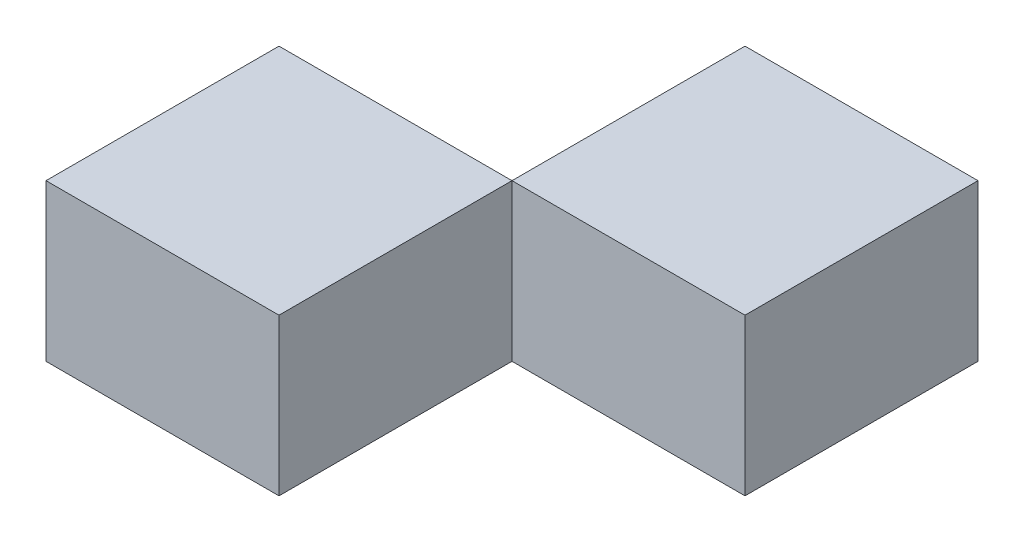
ISO-10303-21;
HEADER;
FILE_DESCRIPTION(('STEP AP214'),'2;1');
FILE_NAME('part.step','',(''),(''),'','','');
FILE_SCHEMA(('AUTOMOTIVE_DESIGN { 1 0 10303 214 1 1 1 1 }'));
ENDSEC;
DATA;
#1=APPLICATION_CONTEXT('core data for automotive mechanical design processes');
#2=APPLICATION_PROTOCOL_DEFINITION('international standard','automotive_design',2000,#1);
#3=PRODUCT_CONTEXT('',#1,'mechanical');
#4=PRODUCT('Part','Part','',(#3));
#5=PRODUCT_RELATED_PRODUCT_CATEGORY('part','',(#4));
#6=PRODUCT_DEFINITION_FORMATION('','',#4);
#7=PRODUCT_DEFINITION_CONTEXT('part definition',#1,'design');
#8=PRODUCT_DEFINITION('design','',#6,#7);
#9=PRODUCT_DEFINITION_SHAPE('','',#8);
#10=(LENGTH_UNIT() NAMED_UNIT(*) SI_UNIT(.MILLI.,.METRE.));
#11=(NAMED_UNIT(*) PLANE_ANGLE_UNIT() SI_UNIT($,.RADIAN.));
#12=(NAMED_UNIT(*) SI_UNIT($,.STERADIAN.) SOLID_ANGLE_UNIT());
#13=UNCERTAINTY_MEASURE_WITH_UNIT(LENGTH_MEASURE(1.E-05),#10,'distance_accuracy_value','');
#14=(GEOMETRIC_REPRESENTATION_CONTEXT(3) GLOBAL_UNCERTAINTY_ASSIGNED_CONTEXT((#13)) GLOBAL_UNIT_ASSIGNED_CONTEXT((#10,
#11,#12)) REPRESENTATION_CONTEXT('',''));
#15=CARTESIAN_POINT('',(0.,0.,0.));
#16=DIRECTION('',(0.,0.,1.));
#17=DIRECTION('',(1.,0.,0.));
#18=AXIS2_PLACEMENT_3D('',#15,#16,#17);
#19=CARTESIAN_POINT('',(0.,13.97,0.));
#20=DIRECTION('',(0.,0.,-1.));
#21=DIRECTION('',(-1.,0.,0.));
#22=AXIS2_PLACEMENT_3D('',#19,#20,#21);
#23=PLANE('',#22);
#24=DIRECTION('',(1.,0.,0.));
#25=VECTOR('',#24,1.);
#26=CARTESIAN_POINT('',(0.,0.,0.));
#27=LINE('',#26,#25);
#28=CARTESIAN_POINT('',(0.,0.,0.));
#29=VERTEX_POINT('',#28);
#30=CARTESIAN_POINT('',(20.8001055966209,0.,0.));
#31=VERTEX_POINT('',#30);
#32=EDGE_CURVE('E107',#29,#31,#27,.T.);
#33=ORIENTED_EDGE('',*,*,#32,.T.);
#34=DIRECTION('',(0.,-1.,0.));
#35=VECTOR('',#34,1.);
#36=CARTESIAN_POINT('',(20.8001055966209,13.97,0.));
#37=LINE('',#36,#35);
#38=CARTESIAN_POINT('',(20.8001055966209,13.97,0.));
#39=VERTEX_POINT('',#38);
#40=EDGE_CURVE('E12',#39,#31,#37,.T.);
#41=ORIENTED_EDGE('',*,*,#40,.F.);
#42=DIRECTION('',(1.,0.,0.));
#43=VECTOR('',#42,1.);
#44=CARTESIAN_POINT('',(0.,13.97,0.));
#45=LINE('',#44,#43);
#46=CARTESIAN_POINT('',(0.,13.97,0.));
#47=VERTEX_POINT('',#46);
#48=EDGE_CURVE('E93',#47,#39,#45,.T.);
#49=ORIENTED_EDGE('',*,*,#48,.F.);
#50=DIRECTION('',(0.,-1.,0.));
#51=VECTOR('',#50,1.);
#52=CARTESIAN_POINT('',(0.,13.97,0.));
#53=LINE('',#52,#51);
#54=EDGE_CURVE('E60',#47,#29,#53,.T.);
#55=ORIENTED_EDGE('',*,*,#54,.T.);
#56=EDGE_LOOP('',(#33,#41,#49,#55));
#57=FACE_BOUND('',#56,.T.);
#58=ADVANCED_FACE('F44',(#57),#23,.F.);
#59=CARTESIAN_POINT('',(20.8001055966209,13.97,0.));
#60=DIRECTION('',(-1.,0.,0.));
#61=DIRECTION('',(0.,0.,1.));
#62=AXIS2_PLACEMENT_3D('',#59,#60,#61);
#63=PLANE('',#62);
#64=DIRECTION('',(0.,0.,-1.));
#65=VECTOR('',#64,1.);
#66=CARTESIAN_POINT('',(20.8001055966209,0.,0.));
#67=LINE('',#66,#65);
#68=CARTESIAN_POINT('',(20.8001055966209,0.,-20.8001055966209));
#69=VERTEX_POINT('',#68);
#70=EDGE_CURVE('E98',#31,#69,#67,.T.);
#71=ORIENTED_EDGE('',*,*,#70,.T.);
#72=DIRECTION('',(0.,-1.,0.));
#73=VECTOR('',#72,1.);
#74=CARTESIAN_POINT('',(20.8001055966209,13.97,-20.8001055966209));
#75=LINE('',#74,#73);
#76=CARTESIAN_POINT('',(20.8001055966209,13.97,-20.8001055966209));
#77=VERTEX_POINT('',#76);
#78=EDGE_CURVE('E52',#77,#69,#75,.T.);
#79=ORIENTED_EDGE('',*,*,#78,.F.);
#80=DIRECTION('',(0.,0.,-1.));
#81=VECTOR('',#80,1.);
#82=CARTESIAN_POINT('',(20.8001055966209,13.97,0.));
#83=LINE('',#82,#81);
#84=EDGE_CURVE('E85',#39,#77,#83,.T.);
#85=ORIENTED_EDGE('',*,*,#84,.F.);
#86=ORIENTED_EDGE('',*,*,#40,.T.);
#87=EDGE_LOOP('',(#71,#79,#85,#86));
#88=FACE_BOUND('',#87,.T.);
#89=ADVANCED_FACE('F97',(#88),#63,.F.);
#90=CARTESIAN_POINT('',(0.,13.97,-20.8001055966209));
#91=DIRECTION('',(0.,0.,-1.));
#92=DIRECTION('',(-1.,0.,0.));
#93=AXIS2_PLACEMENT_3D('',#90,#91,#92);
#94=PLANE('',#93);
#95=DIRECTION('',(1.,0.,0.));
#96=VECTOR('',#95,1.);
#97=CARTESIAN_POINT('',(0.,0.,-20.8001055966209));
#98=LINE('',#97,#96);
#99=CARTESIAN_POINT('',(0.,0.,-20.8001055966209));
#100=VERTEX_POINT('',#99);
#101=EDGE_CURVE('E110',#100,#69,#98,.T.);
#102=ORIENTED_EDGE('',*,*,#101,.F.);
#103=DIRECTION('',(0.,-1.,0.));
#104=VECTOR('',#103,1.);
#105=CARTESIAN_POINT('',(0.,13.97,-20.8001055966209));
#106=LINE('',#105,#104);
#107=CARTESIAN_POINT('',(0.,13.97,-20.8001055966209));
#108=VERTEX_POINT('',#107);
#109=EDGE_CURVE('E74',#108,#100,#106,.T.);
#110=ORIENTED_EDGE('',*,*,#109,.F.);
#111=DIRECTION('',(1.,0.,0.));
#112=VECTOR('',#111,1.);
#113=CARTESIAN_POINT('',(0.,13.97,-20.8001055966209));
#114=LINE('',#113,#112);
#115=EDGE_CURVE('E92',#108,#77,#114,.T.);
#116=ORIENTED_EDGE('',*,*,#115,.T.);
#117=ORIENTED_EDGE('',*,*,#78,.T.);
#118=EDGE_LOOP('',(#102,#110,#116,#117));
#119=FACE_BOUND('',#118,.T.);
#120=ADVANCED_FACE('F101',(#119),#94,.T.);
#121=CARTESIAN_POINT('',(0.,13.97,0.));
#122=DIRECTION('',(-1.,0.,0.));
#123=DIRECTION('',(0.,0.,1.));
#124=AXIS2_PLACEMENT_3D('',#121,#122,#123);
#125=PLANE('',#124);
#126=DIRECTION('',(0.,0.,-1.));
#127=VECTOR('',#126,1.);
#128=CARTESIAN_POINT('',(0.,0.,0.));
#129=LINE('',#128,#127);
#130=EDGE_CURVE('E112',#29,#100,#129,.T.);
#131=ORIENTED_EDGE('',*,*,#130,.F.);
#132=ORIENTED_EDGE('',*,*,#54,.F.);
#133=DIRECTION('',(0.,0.,-1.));
#134=VECTOR('',#133,1.);
#135=CARTESIAN_POINT('',(0.,13.97,0.));
#136=LINE('',#135,#134);
#137=EDGE_CURVE('E102',#47,#108,#136,.T.);
#138=ORIENTED_EDGE('',*,*,#137,.T.);
#139=ORIENTED_EDGE('',*,*,#109,.T.);
#140=EDGE_LOOP('',(#131,#132,#138,#139));
#141=FACE_BOUND('',#140,.T.);
#142=ADVANCED_FACE('F118',(#141),#125,.T.);
#143=CARTESIAN_POINT('',(0.,13.97,0.));
#144=DIRECTION('',(0.,1.,0.));
#145=DIRECTION('',(0.,0.,1.));
#146=AXIS2_PLACEMENT_3D('',#143,#144,#145);
#147=PLANE('',#146);
#148=ORIENTED_EDGE('',*,*,#48,.T.);
#149=ORIENTED_EDGE('',*,*,#84,.T.);
#150=ORIENTED_EDGE('',*,*,#115,.F.);
#151=ORIENTED_EDGE('',*,*,#137,.F.);
#152=EDGE_LOOP('',(#148,#149,#150,#151));
#153=FACE_BOUND('',#152,.T.);
#154=ADVANCED_FACE('F89',(#153),#147,.T.);
#155=CARTESIAN_POINT('',(0.,0.,0.));
#156=DIRECTION('',(0.,1.,0.));
#157=DIRECTION('',(0.,0.,1.));
#158=AXIS2_PLACEMENT_3D('',#155,#156,#157);
#159=PLANE('',#158);
#160=ORIENTED_EDGE('',*,*,#32,.F.);
#161=ORIENTED_EDGE('',*,*,#130,.T.);
#162=ORIENTED_EDGE('',*,*,#101,.T.);
#163=ORIENTED_EDGE('',*,*,#70,.F.);
#164=EDGE_LOOP('',(#160,#161,#162,#163));
#165=FACE_BOUND('',#164,.T.);
#166=ADVANCED_FACE('F117',(#165),#159,.F.);
#167=CLOSED_SHELL('',(#58,#89,#120,#142,#154,#166));
#168=MANIFOLD_SOLID_BREP('B2',#167);
#169=CARTESIAN_POINT('',(0.,13.97,0.));
#170=DIRECTION('',(0.,0.,1.));
#171=DIRECTION('',(1.,0.,0.));
#172=AXIS2_PLACEMENT_3D('',#169,#170,#171);
#173=PLANE('',#172);
#174=DIRECTION('',(-1.,0.,0.));
#175=VECTOR('',#174,1.);
#176=CARTESIAN_POINT('',(0.,0.,0.));
#177=LINE('',#176,#175);
#178=CARTESIAN_POINT('',(0.,0.,0.));
#179=VERTEX_POINT('',#178);
#180=CARTESIAN_POINT('',(-20.8001055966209,0.,0.));
#181=VERTEX_POINT('',#180);
#182=EDGE_CURVE('E230',#179,#181,#177,.T.);
#183=ORIENTED_EDGE('',*,*,#182,.T.);
#184=DIRECTION('',(0.,-1.,0.));
#185=VECTOR('',#184,1.);
#186=CARTESIAN_POINT('',(-20.8001055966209,13.97,0.));
#187=LINE('',#186,#185);
#188=CARTESIAN_POINT('',(-20.8001055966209,13.97,0.));
#189=VERTEX_POINT('',#188);
#190=EDGE_CURVE('E42',#189,#181,#187,.T.);
#191=ORIENTED_EDGE('',*,*,#190,.F.);
#192=DIRECTION('',(-1.,0.,0.));
#193=VECTOR('',#192,1.);
#194=CARTESIAN_POINT('',(0.,13.97,0.));
#195=LINE('',#194,#193);
#196=CARTESIAN_POINT('',(0.,13.97,0.));
#197=VERTEX_POINT('',#196);
#198=EDGE_CURVE('E216',#197,#189,#195,.T.);
#199=ORIENTED_EDGE('',*,*,#198,.F.);
#200=DIRECTION('',(0.,-1.,0.));
#201=VECTOR('',#200,1.);
#202=CARTESIAN_POINT('',(0.,13.97,0.));
#203=LINE('',#202,#201);
#204=EDGE_CURVE('E183',#197,#179,#203,.T.);
#205=ORIENTED_EDGE('',*,*,#204,.T.);
#206=EDGE_LOOP('',(#183,#191,#199,#205));
#207=FACE_BOUND('',#206,.T.);
#208=ADVANCED_FACE('F167',(#207),#173,.F.);
#209=CARTESIAN_POINT('',(-20.8001055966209,13.97,0.));
#210=DIRECTION('',(1.,0.,0.));
#211=DIRECTION('',(0.,0.,-1.));
#212=AXIS2_PLACEMENT_3D('',#209,#210,#211);
#213=PLANE('',#212);
#214=DIRECTION('',(0.,0.,1.));
#215=VECTOR('',#214,1.);
#216=CARTESIAN_POINT('',(-20.8001055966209,0.,0.));
#217=LINE('',#216,#215);
#218=CARTESIAN_POINT('',(-20.8001055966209,0.,20.8001055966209));
#219=VERTEX_POINT('',#218);
#220=EDGE_CURVE('E221',#181,#219,#217,.T.);
#221=ORIENTED_EDGE('',*,*,#220,.T.);
#222=DIRECTION('',(0.,-1.,0.));
#223=VECTOR('',#222,1.);
#224=CARTESIAN_POINT('',(-20.8001055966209,13.97,20.8001055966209));
#225=LINE('',#224,#223);
#226=CARTESIAN_POINT('',(-20.8001055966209,13.97,20.8001055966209));
#227=VERTEX_POINT('',#226);
#228=EDGE_CURVE('E175',#227,#219,#225,.T.);
#229=ORIENTED_EDGE('',*,*,#228,.F.);
#230=DIRECTION('',(0.,0.,1.));
#231=VECTOR('',#230,1.);
#232=CARTESIAN_POINT('',(-20.8001055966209,13.97,0.));
#233=LINE('',#232,#231);
#234=EDGE_CURVE('E208',#189,#227,#233,.T.);
#235=ORIENTED_EDGE('',*,*,#234,.F.);
#236=ORIENTED_EDGE('',*,*,#190,.T.);
#237=EDGE_LOOP('',(#221,#229,#235,#236));
#238=FACE_BOUND('',#237,.T.);
#239=ADVANCED_FACE('F220',(#238),#213,.F.);
#240=CARTESIAN_POINT('',(0.,13.97,20.8001055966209));
#241=DIRECTION('',(0.,0.,1.));
#242=DIRECTION('',(1.,0.,0.));
#243=AXIS2_PLACEMENT_3D('',#240,#241,#242);
#244=PLANE('',#243);
#245=DIRECTION('',(-1.,0.,0.));
#246=VECTOR('',#245,1.);
#247=CARTESIAN_POINT('',(0.,0.,20.8001055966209));
#248=LINE('',#247,#246);
#249=CARTESIAN_POINT('',(0.,0.,20.8001055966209));
#250=VERTEX_POINT('',#249);
#251=EDGE_CURVE('E233',#250,#219,#248,.T.);
#252=ORIENTED_EDGE('',*,*,#251,.F.);
#253=DIRECTION('',(0.,-1.,0.));
#254=VECTOR('',#253,1.);
#255=CARTESIAN_POINT('',(0.,13.97,20.8001055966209));
#256=LINE('',#255,#254);
#257=CARTESIAN_POINT('',(0.,13.97,20.8001055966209));
#258=VERTEX_POINT('',#257);
#259=EDGE_CURVE('E197',#258,#250,#256,.T.);
#260=ORIENTED_EDGE('',*,*,#259,.F.);
#261=DIRECTION('',(-1.,0.,0.));
#262=VECTOR('',#261,1.);
#263=CARTESIAN_POINT('',(0.,13.97,20.8001055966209));
#264=LINE('',#263,#262);
#265=EDGE_CURVE('E215',#258,#227,#264,.T.);
#266=ORIENTED_EDGE('',*,*,#265,.T.);
#267=ORIENTED_EDGE('',*,*,#228,.T.);
#268=EDGE_LOOP('',(#252,#260,#266,#267));
#269=FACE_BOUND('',#268,.T.);
#270=ADVANCED_FACE('F224',(#269),#244,.T.);
#271=CARTESIAN_POINT('',(0.,13.97,0.));
#272=DIRECTION('',(1.,0.,0.));
#273=DIRECTION('',(0.,0.,-1.));
#274=AXIS2_PLACEMENT_3D('',#271,#272,#273);
#275=PLANE('',#274);
#276=DIRECTION('',(0.,0.,1.));
#277=VECTOR('',#276,1.);
#278=CARTESIAN_POINT('',(0.,0.,0.));
#279=LINE('',#278,#277);
#280=EDGE_CURVE('E235',#179,#250,#279,.T.);
#281=ORIENTED_EDGE('',*,*,#280,.F.);
#282=ORIENTED_EDGE('',*,*,#204,.F.);
#283=DIRECTION('',(0.,0.,1.));
#284=VECTOR('',#283,1.);
#285=CARTESIAN_POINT('',(0.,13.97,0.));
#286=LINE('',#285,#284);
#287=EDGE_CURVE('E225',#197,#258,#286,.T.);
#288=ORIENTED_EDGE('',*,*,#287,.T.);
#289=ORIENTED_EDGE('',*,*,#259,.T.);
#290=EDGE_LOOP('',(#281,#282,#288,#289));
#291=FACE_BOUND('',#290,.T.);
#292=ADVANCED_FACE('F241',(#291),#275,.T.);
#293=CARTESIAN_POINT('',(0.,13.97,0.));
#294=DIRECTION('',(0.,1.,0.));
#295=DIRECTION('',(0.,0.,1.));
#296=AXIS2_PLACEMENT_3D('',#293,#294,#295);
#297=PLANE('',#296);
#298=ORIENTED_EDGE('',*,*,#198,.T.);
#299=ORIENTED_EDGE('',*,*,#234,.T.);
#300=ORIENTED_EDGE('',*,*,#265,.F.);
#301=ORIENTED_EDGE('',*,*,#287,.F.);
#302=EDGE_LOOP('',(#298,#299,#300,#301));
#303=FACE_BOUND('',#302,.T.);
#304=ADVANCED_FACE('F212',(#303),#297,.T.);
#305=CARTESIAN_POINT('',(0.,0.,0.));
#306=DIRECTION('',(0.,1.,0.));
#307=DIRECTION('',(0.,0.,1.));
#308=AXIS2_PLACEMENT_3D('',#305,#306,#307);
#309=PLANE('',#308);
#310=ORIENTED_EDGE('',*,*,#182,.F.);
#311=ORIENTED_EDGE('',*,*,#280,.T.);
#312=ORIENTED_EDGE('',*,*,#251,.T.);
#313=ORIENTED_EDGE('',*,*,#220,.F.);
#314=EDGE_LOOP('',(#310,#311,#312,#313));
#315=FACE_BOUND('',#314,.T.);
#316=ADVANCED_FACE('F240',(#315),#309,.F.);
#317=CLOSED_SHELL('',(#208,#239,#270,#292,#304,#316));
#318=MANIFOLD_SOLID_BREP('B6',#317);
#319=ADVANCED_BREP_SHAPE_REPRESENTATION('',(#18,#168,#318),#14);
#320=SHAPE_DEFINITION_REPRESENTATION(#9,#319);
ENDSEC;
END-ISO-10303-21;
